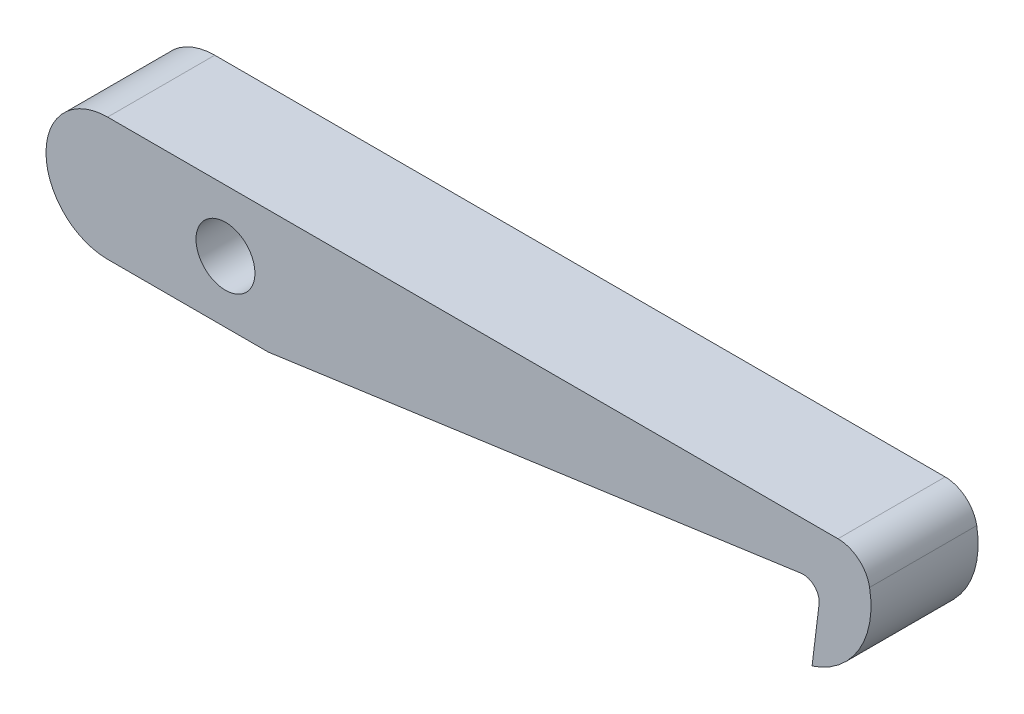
ISO-10303-21;
HEADER;
FILE_DESCRIPTION(('STEP AP214'),'2;1');
FILE_NAME('part.step','',(''),(''),'','','');
FILE_SCHEMA(('AUTOMOTIVE_DESIGN { 1 0 10303 214 1 1 1 1 }'));
ENDSEC;
DATA;
#1=APPLICATION_CONTEXT('core data for automotive mechanical design processes');
#2=APPLICATION_PROTOCOL_DEFINITION('international standard','automotive_design',2000,#1);
#3=PRODUCT_CONTEXT('',#1,'mechanical');
#4=PRODUCT('Part','Part','',(#3));
#5=PRODUCT_RELATED_PRODUCT_CATEGORY('part','',(#4));
#6=PRODUCT_DEFINITION_FORMATION('','',#4);
#7=PRODUCT_DEFINITION_CONTEXT('part definition',#1,'design');
#8=PRODUCT_DEFINITION('design','',#6,#7);
#9=PRODUCT_DEFINITION_SHAPE('','',#8);
#10=(LENGTH_UNIT() NAMED_UNIT(*) SI_UNIT(.MILLI.,.METRE.));
#11=(NAMED_UNIT(*) PLANE_ANGLE_UNIT() SI_UNIT($,.RADIAN.));
#12=(NAMED_UNIT(*) SI_UNIT($,.STERADIAN.) SOLID_ANGLE_UNIT());
#13=UNCERTAINTY_MEASURE_WITH_UNIT(LENGTH_MEASURE(1.E-05),#10,'distance_accuracy_value','');
#14=(GEOMETRIC_REPRESENTATION_CONTEXT(3) GLOBAL_UNCERTAINTY_ASSIGNED_CONTEXT((#13)) GLOBAL_UNIT_ASSIGNED_CONTEXT((#10,
#11,#12)) REPRESENTATION_CONTEXT('',''));
#15=CARTESIAN_POINT('',(0.,0.,0.));
#16=DIRECTION('',(0.,0.,1.));
#17=DIRECTION('',(1.,0.,0.));
#18=AXIS2_PLACEMENT_3D('',#15,#16,#17);
#19=CARTESIAN_POINT('',(-11.,0.,9.99999999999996));
#20=DIRECTION('',(0.,0.,-0.999999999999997));
#21=DIRECTION('',(-1.00000000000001,0.,0.));
#22=AXIS2_PLACEMENT_3D('',#19,#20,#21);
#23=PLANE('',#22);
#24=CARTESIAN_POINT('',(-11.,0.,9.99999999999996));
#25=DIRECTION('',(0.,0.,0.999999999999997));
#26=DIRECTION('',(-1.00000000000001,0.,0.));
#27=AXIS2_PLACEMENT_3D('',#24,#25,#26);
#28=CIRCLE('',#27,5.75);
#29=CARTESIAN_POINT('',(-11.,5.75000000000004,9.99999999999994));
#30=VERTEX_POINT('',#29);
#31=CARTESIAN_POINT('',(-11.,-5.75,9.99999999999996));
#32=VERTEX_POINT('',#31);
#33=EDGE_CURVE('E144',#30,#32,#28,.T.);
#34=ORIENTED_EDGE('',*,*,#33,.T.);
#35=DIRECTION('',(1.00000000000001,0.,0.));
#36=VECTOR('',#35,1.);
#37=CARTESIAN_POINT('',(4.00000000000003,-5.75,9.99999999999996));
#38=LINE('',#37,#36);
#39=CARTESIAN_POINT('',(4.00000000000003,-5.75,9.99999999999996));
#40=VERTEX_POINT('',#39);
#41=EDGE_CURVE('E92',#32,#40,#38,.T.);
#42=ORIENTED_EDGE('',*,*,#41,.T.);
#43=DIRECTION('',(0.990268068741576,0.139173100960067,0.));
#44=VECTOR('',#43,1.);
#45=CARTESIAN_POINT('',(53.7037186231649,1.23540210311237,9.99999999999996));
#46=LINE('',#45,#44);
#47=CARTESIAN_POINT('',(53.7037186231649,1.23540210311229,9.99999999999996));
#48=VERTEX_POINT('',#47);
#49=EDGE_CURVE('E159',#40,#48,#46,.T.);
#50=ORIENTED_EDGE('',*,*,#49,.T.);
#51=CARTESIAN_POINT('',(53.912478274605,-0.25,9.99999999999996));
#52=DIRECTION('',(0.,0.,-0.999999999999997));
#53=DIRECTION('',(1.00000000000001,0.,0.));
#54=AXIS2_PLACEMENT_3D('',#51,#52,#53);
#55=CIRCLE('',#54,1.49999999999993);
#56=CARTESIAN_POINT('',(55.4012975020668,-0.432804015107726,9.99999999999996));
#57=VERTEX_POINT('',#56);
#58=EDGE_CURVE('E172',#48,#57,#55,.T.);
#59=ORIENTED_EDGE('',*,*,#58,.T.);
#60=DIRECTION('',(-0.121869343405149,-0.992546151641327,0.));
#61=VECTOR('',#60,1.);
#62=CARTESIAN_POINT('',(54.7484279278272,-5.75,9.99999999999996));
#63=LINE('',#62,#61);
#64=CARTESIAN_POINT('',(54.7484279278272,-5.75000000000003,9.99999999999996));
#65=VERTEX_POINT('',#64);
#66=EDGE_CURVE('E111',#57,#65,#63,.T.);
#67=ORIENTED_EDGE('',*,*,#66,.T.);
#68=CARTESIAN_POINT('',(52.2500000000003,1.84985907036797,9.99999999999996));
#69=DIRECTION('',(0.,0.,0.999999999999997));
#70=DIRECTION('',(1.00000000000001,0.,0.));
#71=AXIS2_PLACEMENT_3D('',#68,#69,#70);
#72=CIRCLE('',#71,7.99999999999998);
#73=CARTESIAN_POINT('',(60.1192916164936,3.29008455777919,9.99999999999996));
#74=VERTEX_POINT('',#73);
#75=EDGE_CURVE('E105',#65,#74,#72,.T.);
#76=ORIENTED_EDGE('',*,*,#75,.T.);
#77=CARTESIAN_POINT('',(57.1683072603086,2.75,9.99999999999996));
#78=DIRECTION('',(0.,0.,0.999999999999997));
#79=DIRECTION('',(-1.00000000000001,0.,0.));
#80=AXIS2_PLACEMENT_3D('',#77,#78,#79);
#81=CIRCLE('',#80,3.);
#82=CARTESIAN_POINT('',(57.1683072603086,5.75000000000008,9.99999999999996));
#83=VERTEX_POINT('',#82);
#84=EDGE_CURVE('E109',#74,#83,#81,.T.);
#85=ORIENTED_EDGE('',*,*,#84,.T.);
#86=DIRECTION('',(-1.00000000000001,0.,0.));
#87=VECTOR('',#86,1.);
#88=CARTESIAN_POINT('',(-11.,5.75000000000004,9.99999999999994));
#89=LINE('',#88,#87);
#90=EDGE_CURVE('E49',#83,#30,#89,.T.);
#91=ORIENTED_EDGE('',*,*,#90,.T.);
#92=EDGE_LOOP('',(#34,#42,#50,#59,#67,#76,#85,#91));
#93=FACE_BOUND('',#92,.T.);
#94=CARTESIAN_POINT('',(0.,0.,9.99999999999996));
#95=DIRECTION('',(0.,0.,0.999999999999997));
#96=DIRECTION('',(1.00000000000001,0.,0.));
#97=AXIS2_PLACEMENT_3D('',#94,#95,#96);
#98=CIRCLE('',#97,2.75);
#99=CARTESIAN_POINT('',(-2.75000000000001,0.,9.99999999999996));
#100=VERTEX_POINT('',#99);
#101=EDGE_CURVE('E133',#100,#100,#98,.T.);
#102=ORIENTED_EDGE('',*,*,#101,.F.);
#103=EDGE_LOOP('',(#102));
#104=FACE_BOUND('',#103,.T.);
#105=ADVANCED_FACE('F32',(#93,#104),#23,.F.);
#106=CARTESIAN_POINT('',(-11.,0.,0.));
#107=DIRECTION('',(0.,0.,-0.999999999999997));
#108=DIRECTION('',(-1.00000000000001,0.,0.));
#109=AXIS2_PLACEMENT_3D('',#106,#107,#108);
#110=PLANE('',#109);
#111=CARTESIAN_POINT('',(-11.,0.,0.));
#112=DIRECTION('',(0.,0.,0.999999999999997));
#113=DIRECTION('',(-1.00000000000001,0.,0.));
#114=AXIS2_PLACEMENT_3D('',#111,#112,#113);
#115=CIRCLE('',#114,5.75);
#116=CARTESIAN_POINT('',(-11.,5.75000000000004,0.));
#117=VERTEX_POINT('',#116);
#118=CARTESIAN_POINT('',(-11.,-5.75,0.));
#119=VERTEX_POINT('',#118);
#120=EDGE_CURVE('E129',#117,#119,#115,.T.);
#121=ORIENTED_EDGE('',*,*,#120,.F.);
#122=DIRECTION('',(-1.00000000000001,0.,0.));
#123=VECTOR('',#122,1.);
#124=CARTESIAN_POINT('',(-11.,5.75000000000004,0.));
#125=LINE('',#124,#123);
#126=CARTESIAN_POINT('',(57.1683072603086,5.75000000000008,0.));
#127=VERTEX_POINT('',#126);
#128=EDGE_CURVE('E84',#127,#117,#125,.T.);
#129=ORIENTED_EDGE('',*,*,#128,.F.);
#130=CARTESIAN_POINT('',(57.1683072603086,2.75,0.));
#131=DIRECTION('',(0.,0.,0.999999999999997));
#132=DIRECTION('',(-1.00000000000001,0.,0.));
#133=AXIS2_PLACEMENT_3D('',#130,#131,#132);
#134=CIRCLE('',#133,3.);
#135=CARTESIAN_POINT('',(60.1192916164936,3.29008455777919,0.));
#136=VERTEX_POINT('',#135);
#137=EDGE_CURVE('E78',#136,#127,#134,.T.);
#138=ORIENTED_EDGE('',*,*,#137,.F.);
#139=CARTESIAN_POINT('',(52.2500000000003,1.84985907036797,0.));
#140=DIRECTION('',(0.,0.,0.999999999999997));
#141=DIRECTION('',(1.00000000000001,0.,0.));
#142=AXIS2_PLACEMENT_3D('',#139,#140,#141);
#143=CIRCLE('',#142,7.99999999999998);
#144=CARTESIAN_POINT('',(54.7484279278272,-5.75000000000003,0.));
#145=VERTEX_POINT('',#144);
#146=EDGE_CURVE('E119',#145,#136,#143,.T.);
#147=ORIENTED_EDGE('',*,*,#146,.F.);
#148=DIRECTION('',(-0.121869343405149,-0.992546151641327,0.));
#149=VECTOR('',#148,1.);
#150=CARTESIAN_POINT('',(54.7484279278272,-5.75,0.));
#151=LINE('',#150,#149);
#152=CARTESIAN_POINT('',(55.4012975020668,-0.432804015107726,0.));
#153=VERTEX_POINT('',#152);
#154=EDGE_CURVE('E139',#153,#145,#151,.T.);
#155=ORIENTED_EDGE('',*,*,#154,.F.);
#156=CARTESIAN_POINT('',(53.912478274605,-0.25,0.));
#157=DIRECTION('',(0.,0.,-0.999999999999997));
#158=DIRECTION('',(1.00000000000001,0.,0.));
#159=AXIS2_PLACEMENT_3D('',#156,#157,#158);
#160=CIRCLE('',#159,1.49999999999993);
#161=CARTESIAN_POINT('',(53.7037186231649,1.23540210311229,0.));
#162=VERTEX_POINT('',#161);
#163=EDGE_CURVE('E137',#162,#153,#160,.T.);
#164=ORIENTED_EDGE('',*,*,#163,.F.);
#165=DIRECTION('',(0.990268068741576,0.139173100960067,0.));
#166=VECTOR('',#165,1.);
#167=CARTESIAN_POINT('',(53.7037186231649,1.23540210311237,0.));
#168=LINE('',#167,#166);
#169=CARTESIAN_POINT('',(4.00000000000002,-5.75,0.));
#170=VERTEX_POINT('',#169);
#171=EDGE_CURVE('E135',#170,#162,#168,.T.);
#172=ORIENTED_EDGE('',*,*,#171,.F.);
#173=DIRECTION('',(1.00000000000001,0.,0.));
#174=VECTOR('',#173,1.);
#175=CARTESIAN_POINT('',(4.00000000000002,-5.75,0.));
#176=LINE('',#175,#174);
#177=EDGE_CURVE('E132',#119,#170,#176,.T.);
#178=ORIENTED_EDGE('',*,*,#177,.F.);
#179=EDGE_LOOP('',(#121,#129,#138,#147,#155,#164,#172,#178));
#180=FACE_BOUND('',#179,.T.);
#181=CARTESIAN_POINT('',(0.,0.,0.));
#182=DIRECTION('',(0.,0.,0.999999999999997));
#183=DIRECTION('',(1.00000000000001,0.,0.));
#184=AXIS2_PLACEMENT_3D('',#181,#182,#183);
#185=CIRCLE('',#184,2.75);
#186=CARTESIAN_POINT('',(-2.75000000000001,0.,0.));
#187=VERTEX_POINT('',#186);
#188=EDGE_CURVE('E178',#187,#187,#185,.T.);
#189=ORIENTED_EDGE('',*,*,#188,.T.);
#190=EDGE_LOOP('',(#189));
#191=FACE_BOUND('',#190,.T.);
#192=ADVANCED_FACE('F163',(#180,#191),#110,.T.);
#193=CARTESIAN_POINT('',(-11.,0.,9.99999999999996));
#194=DIRECTION('',(0.,0.,-0.999999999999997));
#195=DIRECTION('',(-1.00000000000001,0.,0.));
#196=AXIS2_PLACEMENT_3D('',#193,#194,#195);
#197=CYLINDRICAL_SURFACE('',#196,5.75);
#198=ORIENTED_EDGE('',*,*,#120,.T.);
#199=DIRECTION('',(0.,0.,-0.999999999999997));
#200=VECTOR('',#199,1.);
#201=CARTESIAN_POINT('',(-11.,-5.75,9.99999999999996));
#202=LINE('',#201,#200);
#203=EDGE_CURVE('E11',#32,#119,#202,.T.);
#204=ORIENTED_EDGE('',*,*,#203,.F.);
#205=ORIENTED_EDGE('',*,*,#33,.F.);
#206=DIRECTION('',(0.,0.,-0.999999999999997));
#207=VECTOR('',#206,1.);
#208=CARTESIAN_POINT('',(-11.,5.75000000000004,9.99999999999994));
#209=LINE('',#208,#207);
#210=EDGE_CURVE('E125',#30,#117,#209,.T.);
#211=ORIENTED_EDGE('',*,*,#210,.T.);
#212=EDGE_LOOP('',(#198,#204,#205,#211));
#213=FACE_BOUND('',#212,.T.);
#214=ADVANCED_FACE('F34',(#213),#197,.T.);
#215=CARTESIAN_POINT('',(4.00000000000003,-5.75,9.99999999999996));
#216=DIRECTION('',(0.,1.00000000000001,0.));
#217=DIRECTION('',(0.,0.,0.999999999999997));
#218=AXIS2_PLACEMENT_3D('',#215,#216,#217);
#219=PLANE('',#218);
#220=ORIENTED_EDGE('',*,*,#177,.T.);
#221=DIRECTION('',(0.,0.,-0.999999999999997));
#222=VECTOR('',#221,1.);
#223=CARTESIAN_POINT('',(4.00000000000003,-5.75,9.99999999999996));
#224=LINE('',#223,#222);
#225=EDGE_CURVE('E41',#40,#170,#224,.T.);
#226=ORIENTED_EDGE('',*,*,#225,.F.);
#227=ORIENTED_EDGE('',*,*,#41,.F.);
#228=ORIENTED_EDGE('',*,*,#203,.T.);
#229=EDGE_LOOP('',(#220,#226,#227,#228));
#230=FACE_BOUND('',#229,.T.);
#231=ADVANCED_FACE('F206',(#230),#219,.F.);
#232=CARTESIAN_POINT('',(53.7037186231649,1.23540210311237,9.99999999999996));
#233=DIRECTION('',(-0.139173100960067,0.990268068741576,0.));
#234=DIRECTION('',(-0.990268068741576,-0.139173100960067,0.));
#235=AXIS2_PLACEMENT_3D('',#232,#233,#234);
#236=PLANE('',#235);
#237=ORIENTED_EDGE('',*,*,#171,.T.);
#238=DIRECTION('',(0.,0.,-0.999999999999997));
#239=VECTOR('',#238,1.);
#240=CARTESIAN_POINT('',(53.7037186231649,1.23540210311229,9.99999999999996));
#241=LINE('',#240,#239);
#242=EDGE_CURVE('E151',#48,#162,#241,.T.);
#243=ORIENTED_EDGE('',*,*,#242,.F.);
#244=ORIENTED_EDGE('',*,*,#49,.F.);
#245=ORIENTED_EDGE('',*,*,#225,.T.);
#246=EDGE_LOOP('',(#237,#243,#244,#245));
#247=FACE_BOUND('',#246,.T.);
#248=ADVANCED_FACE('F157',(#247),#236,.F.);
#249=CARTESIAN_POINT('',(53.912478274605,-0.25,9.99999999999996));
#250=DIRECTION('',(0.,0.,-0.999999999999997));
#251=DIRECTION('',(-1.00000000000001,0.,0.));
#252=AXIS2_PLACEMENT_3D('',#249,#250,#251);
#253=CYLINDRICAL_SURFACE('',#252,1.49999999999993);
#254=ORIENTED_EDGE('',*,*,#163,.T.);
#255=DIRECTION('',(0.,0.,-0.999999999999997));
#256=VECTOR('',#255,1.);
#257=CARTESIAN_POINT('',(55.4012975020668,-0.432804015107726,9.99999999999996));
#258=LINE('',#257,#256);
#259=EDGE_CURVE('E148',#57,#153,#258,.T.);
#260=ORIENTED_EDGE('',*,*,#259,.F.);
#261=ORIENTED_EDGE('',*,*,#58,.F.);
#262=ORIENTED_EDGE('',*,*,#242,.T.);
#263=EDGE_LOOP('',(#254,#260,#261,#262));
#264=FACE_BOUND('',#263,.T.);
#265=ADVANCED_FACE('F168',(#264),#253,.F.);
#266=CARTESIAN_POINT('',(54.7484279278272,-5.75,9.99999999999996));
#267=DIRECTION('',(0.992546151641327,-0.121869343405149,0.));
#268=DIRECTION('',(0.121869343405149,0.992546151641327,0.));
#269=AXIS2_PLACEMENT_3D('',#266,#267,#268);
#270=PLANE('',#269);
#271=ORIENTED_EDGE('',*,*,#154,.T.);
#272=DIRECTION('',(0.,0.,-0.999999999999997));
#273=VECTOR('',#272,1.);
#274=CARTESIAN_POINT('',(54.7484279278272,-5.75000000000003,9.99999999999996));
#275=LINE('',#274,#273);
#276=EDGE_CURVE('E120',#65,#145,#275,.T.);
#277=ORIENTED_EDGE('',*,*,#276,.F.);
#278=ORIENTED_EDGE('',*,*,#66,.F.);
#279=ORIENTED_EDGE('',*,*,#259,.T.);
#280=EDGE_LOOP('',(#271,#277,#278,#279));
#281=FACE_BOUND('',#280,.T.);
#282=ADVANCED_FACE('F171',(#281),#270,.F.);
#283=CARTESIAN_POINT('',(52.2500000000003,1.84985907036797,9.99999999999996));
#284=DIRECTION('',(0.,0.,-0.999999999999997));
#285=DIRECTION('',(-1.00000000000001,0.,0.));
#286=AXIS2_PLACEMENT_3D('',#283,#284,#285);
#287=CYLINDRICAL_SURFACE('',#286,7.99999999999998);
#288=ORIENTED_EDGE('',*,*,#146,.T.);
#289=DIRECTION('',(0.,0.,-0.999999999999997));
#290=VECTOR('',#289,1.);
#291=CARTESIAN_POINT('',(60.1192916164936,3.29008455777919,9.99999999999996));
#292=LINE('',#291,#290);
#293=EDGE_CURVE('E116',#74,#136,#292,.T.);
#294=ORIENTED_EDGE('',*,*,#293,.F.);
#295=ORIENTED_EDGE('',*,*,#75,.F.);
#296=ORIENTED_EDGE('',*,*,#276,.T.);
#297=EDGE_LOOP('',(#288,#294,#295,#296));
#298=FACE_BOUND('',#297,.T.);
#299=ADVANCED_FACE('F117',(#298),#287,.T.);
#300=CARTESIAN_POINT('',(57.1683072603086,2.75,9.99999999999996));
#301=DIRECTION('',(0.,0.,-0.999999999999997));
#302=DIRECTION('',(-1.00000000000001,0.,0.));
#303=AXIS2_PLACEMENT_3D('',#300,#301,#302);
#304=CYLINDRICAL_SURFACE('',#303,3.);
#305=ORIENTED_EDGE('',*,*,#137,.T.);
#306=DIRECTION('',(0.,0.,-0.999999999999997));
#307=VECTOR('',#306,1.);
#308=CARTESIAN_POINT('',(57.1683072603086,5.75000000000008,9.99999999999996));
#309=LINE('',#308,#307);
#310=EDGE_CURVE('E121',#83,#127,#309,.T.);
#311=ORIENTED_EDGE('',*,*,#310,.F.);
#312=ORIENTED_EDGE('',*,*,#84,.F.);
#313=ORIENTED_EDGE('',*,*,#293,.T.);
#314=EDGE_LOOP('',(#305,#311,#312,#313));
#315=FACE_BOUND('',#314,.T.);
#316=ADVANCED_FACE('F123',(#315),#304,.T.);
#317=CARTESIAN_POINT('',(-11.,5.75000000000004,9.99999999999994));
#318=DIRECTION('',(0.,-1.00000000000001,0.));
#319=DIRECTION('',(1.00000000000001,0.,0.));
#320=AXIS2_PLACEMENT_3D('',#317,#318,#319);
#321=PLANE('',#320);
#322=ORIENTED_EDGE('',*,*,#128,.T.);
#323=ORIENTED_EDGE('',*,*,#210,.F.);
#324=ORIENTED_EDGE('',*,*,#90,.F.);
#325=ORIENTED_EDGE('',*,*,#310,.T.);
#326=EDGE_LOOP('',(#322,#323,#324,#325));
#327=FACE_BOUND('',#326,.T.);
#328=ADVANCED_FACE('F194',(#327),#321,.F.);
#329=CARTESIAN_POINT('',(0.,0.,9.99999999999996));
#330=DIRECTION('',(0.,0.,-0.999999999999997));
#331=DIRECTION('',(-1.00000000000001,0.,0.));
#332=AXIS2_PLACEMENT_3D('',#329,#330,#331);
#333=CYLINDRICAL_SURFACE('',#332,2.75);
#334=CARTESIAN_POINT('',(-2.75000000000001,0.,9.99999999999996));
#335=CARTESIAN_POINT('',(-2.75000000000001,0.,9.89583333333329));
#336=CARTESIAN_POINT('',(-2.75000000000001,0.,9.79166666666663));
#337=CARTESIAN_POINT('',(-2.75000000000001,0.,9.58333333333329));
#338=CARTESIAN_POINT('',(-2.75000000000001,0.,9.47916666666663));
#339=CARTESIAN_POINT('',(-2.75000000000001,0.,9.2708333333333));
#340=CARTESIAN_POINT('',(-2.75000000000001,0.,9.16666666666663));
#341=CARTESIAN_POINT('',(-2.75000000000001,0.,8.9583333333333));
#342=CARTESIAN_POINT('',(-2.75000000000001,0.,8.85416666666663));
#343=CARTESIAN_POINT('',(-2.75000000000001,0.,8.6458333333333));
#344=CARTESIAN_POINT('',(-2.75000000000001,0.,8.54166666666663));
#345=CARTESIAN_POINT('',(-2.75000000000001,0.,8.3333333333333));
#346=CARTESIAN_POINT('',(-2.75000000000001,0.,8.22916666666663));
#347=CARTESIAN_POINT('',(-2.75000000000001,0.,8.0208333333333));
#348=CARTESIAN_POINT('',(-2.75000000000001,0.,7.91666666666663));
#349=CARTESIAN_POINT('',(-2.75000000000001,0.,7.7083333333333));
#350=CARTESIAN_POINT('',(-2.75000000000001,0.,7.60416666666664));
#351=CARTESIAN_POINT('',(-2.75000000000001,0.,7.3958333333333));
#352=CARTESIAN_POINT('',(-2.75000000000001,0.,7.29166666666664));
#353=CARTESIAN_POINT('',(-2.75000000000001,0.,7.08333333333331));
#354=CARTESIAN_POINT('',(-2.75000000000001,0.,6.97916666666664));
#355=CARTESIAN_POINT('',(-2.75000000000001,0.,6.77083333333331));
#356=CARTESIAN_POINT('',(-2.75000000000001,0.,6.66666666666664));
#357=CARTESIAN_POINT('',(-2.75000000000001,0.,6.45833333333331));
#358=CARTESIAN_POINT('',(-2.75000000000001,0.,6.35416666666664));
#359=CARTESIAN_POINT('',(-2.75000000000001,0.,6.14583333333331));
#360=CARTESIAN_POINT('',(-2.75000000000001,0.,6.04166666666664));
#361=CARTESIAN_POINT('',(-2.75000000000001,0.,5.83333333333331));
#362=CARTESIAN_POINT('',(-2.75000000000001,0.,5.72916666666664));
#363=CARTESIAN_POINT('',(-2.75000000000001,0.,5.52083333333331));
#364=CARTESIAN_POINT('',(-2.75000000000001,0.,5.41666666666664));
#365=CARTESIAN_POINT('',(-2.75000000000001,0.,5.20833333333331));
#366=CARTESIAN_POINT('',(-2.75000000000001,0.,5.10416666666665));
#367=CARTESIAN_POINT('',(-2.75000000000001,0.,4.89583333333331));
#368=CARTESIAN_POINT('',(-2.75000000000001,0.,4.79166666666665));
#369=CARTESIAN_POINT('',(-2.75000000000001,0.,4.58333333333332));
#370=CARTESIAN_POINT('',(-2.75000000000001,0.,4.47916666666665));
#371=CARTESIAN_POINT('',(-2.75000000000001,0.,4.27083333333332));
#372=CARTESIAN_POINT('',(-2.75000000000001,0.,4.16666666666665));
#373=CARTESIAN_POINT('',(-2.75000000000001,0.,3.95833333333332));
#374=CARTESIAN_POINT('',(-2.75000000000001,0.,3.85416666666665));
#375=CARTESIAN_POINT('',(-2.75000000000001,0.,3.64583333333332));
#376=CARTESIAN_POINT('',(-2.75000000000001,0.,3.54166666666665));
#377=CARTESIAN_POINT('',(-2.75000000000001,0.,3.33333333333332));
#378=CARTESIAN_POINT('',(-2.75000000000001,0.,3.22916666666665));
#379=CARTESIAN_POINT('',(-2.75000000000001,0.,3.02083333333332));
#380=CARTESIAN_POINT('',(-2.75000000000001,0.,2.91666666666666));
#381=CARTESIAN_POINT('',(-2.75000000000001,0.,2.70833333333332));
#382=CARTESIAN_POINT('',(-2.75000000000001,0.,2.60416666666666));
#383=CARTESIAN_POINT('',(-2.75000000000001,0.,2.39583333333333));
#384=CARTESIAN_POINT('',(-2.75000000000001,0.,2.29166666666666));
#385=CARTESIAN_POINT('',(-2.75000000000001,0.,2.08333333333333));
#386=CARTESIAN_POINT('',(-2.75000000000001,0.,1.97916666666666));
#387=CARTESIAN_POINT('',(-2.75000000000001,0.,1.77083333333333));
#388=CARTESIAN_POINT('',(-2.75000000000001,0.,1.66666666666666));
#389=CARTESIAN_POINT('',(-2.75000000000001,0.,1.45833333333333));
#390=CARTESIAN_POINT('',(-2.75000000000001,0.,1.35416666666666));
#391=CARTESIAN_POINT('',(-2.75000000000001,0.,1.14583333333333));
#392=CARTESIAN_POINT('',(-2.75000000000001,0.,1.04166666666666));
#393=CARTESIAN_POINT('',(-2.75000000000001,0.,0.833333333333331));
#394=CARTESIAN_POINT('',(-2.75000000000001,0.,0.729166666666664));
#395=CARTESIAN_POINT('',(-2.75000000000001,0.,0.520833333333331));
#396=CARTESIAN_POINT('',(-2.75000000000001,0.,0.416666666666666));
#397=CARTESIAN_POINT('',(-2.75000000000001,0.,0.208333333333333));
#398=CARTESIAN_POINT('',(-2.75000000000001,0.,0.104166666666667));
#399=CARTESIAN_POINT('',(-2.75000000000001,0.,0.));
#400=B_SPLINE_CURVE_WITH_KNOTS('',3,(#334,#335,#336,#337,#338,#339,#340,#341,#342,#343,#344,
#345,#346,#347,#348,#349,#350,#351,#352,#353,#354,#355,#356,#357,#358,#359,#360,#361,#362,#363,
#364,#365,#366,#367,#368,#369,#370,#371,#372,#373,#374,#375,#376,#377,#378,#379,#380,#381,#382,
#383,#384,#385,#386,#387,#388,#389,#390,#391,#392,#393,#394,#395,#396,#397,#398,#399),
.UNSPECIFIED.,.F.,.F.,(4,2,2,2,2,2,2,2,2,2,2,2,2,2,2,2,2,2,2,2,2,2,2,2,2,2,2,2,2,2,2,2,4),(0.,
0.312499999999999,0.624999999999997,0.937499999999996,1.24999999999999,1.56249999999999,
1.87499999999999,2.18749999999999,2.49999999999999,2.81249999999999,3.12499999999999,
3.43749999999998,3.74999999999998,4.06249999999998,4.37499999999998,4.68749999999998,
4.99999999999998,5.31249999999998,5.62499999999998,5.93749999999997,6.24999999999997,
6.56249999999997,6.87499999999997,7.18749999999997,7.49999999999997,7.81249999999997,
8.12499999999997,8.43749999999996,8.74999999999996,9.06249999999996,9.37499999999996,
9.68749999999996,9.99999999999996),.UNSPECIFIED.);
#401=EDGE_CURVE('BSEAM184',#100,#187,#400,.T.);
#402=ORIENTED_EDGE('',*,*,#101,.T.);
#403=ORIENTED_EDGE('',*,*,#188,.F.);
#404=ORIENTED_EDGE('',*,*,#401,.T.);
#405=ORIENTED_EDGE('',*,*,#401,.F.);
#406=EDGE_LOOP('',(#402,#404,#403,#405));
#407=FACE_BOUND('',#406,.T.);
#408=ADVANCED_FACE('F184',(#407),#333,.F.);
#409=CLOSED_SHELL('',(#105,#192,#214,#231,#248,#265,#282,#299,#316,#328,#408));
#410=MANIFOLD_SOLID_BREP('B2',#409);
#411=ADVANCED_BREP_SHAPE_REPRESENTATION('',(#18,#410),#14);
#412=SHAPE_DEFINITION_REPRESENTATION(#9,#411);
ENDSEC;
END-ISO-10303-21;
